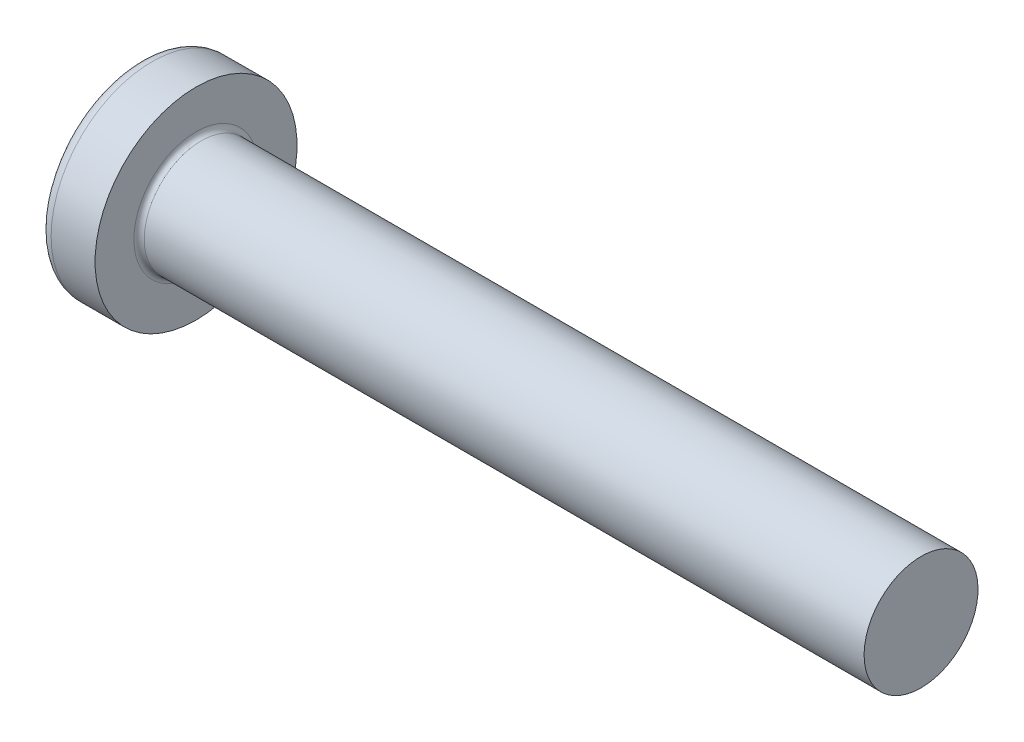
ISO-10303-21;
HEADER;
FILE_DESCRIPTION(('STEP AP214'),'2;1');
FILE_NAME('part.step','',(''),(''),'','','');
FILE_SCHEMA(('AUTOMOTIVE_DESIGN { 1 0 10303 214 1 1 1 1 }'));
ENDSEC;
DATA;
#1=APPLICATION_CONTEXT('core data for automotive mechanical design processes');
#2=APPLICATION_PROTOCOL_DEFINITION('international standard','automotive_design',2000,#1);
#3=PRODUCT_CONTEXT('',#1,'mechanical');
#4=PRODUCT('Part','Part','',(#3));
#5=PRODUCT_RELATED_PRODUCT_CATEGORY('part','',(#4));
#6=PRODUCT_DEFINITION_FORMATION('','',#4);
#7=PRODUCT_DEFINITION_CONTEXT('part definition',#1,'design');
#8=PRODUCT_DEFINITION('design','',#6,#7);
#9=PRODUCT_DEFINITION_SHAPE('','',#8);
#10=(LENGTH_UNIT() NAMED_UNIT(*) SI_UNIT(.MILLI.,.METRE.));
#11=(NAMED_UNIT(*) PLANE_ANGLE_UNIT() SI_UNIT($,.RADIAN.));
#12=(NAMED_UNIT(*) SI_UNIT($,.STERADIAN.) SOLID_ANGLE_UNIT());
#13=UNCERTAINTY_MEASURE_WITH_UNIT(LENGTH_MEASURE(1.E-05),#10,'distance_accuracy_value','');
#14=(GEOMETRIC_REPRESENTATION_CONTEXT(3) GLOBAL_UNCERTAINTY_ASSIGNED_CONTEXT((#13)) GLOBAL_UNIT_ASSIGNED_CONTEXT((#10,
#11,#12)) REPRESENTATION_CONTEXT('',''));
#15=CARTESIAN_POINT('',(0.,0.,0.));
#16=DIRECTION('',(0.,0.,1.));
#17=DIRECTION('',(1.,0.,0.));
#18=AXIS2_PLACEMENT_3D('',#15,#16,#17);
#19=CARTESIAN_POINT('',(1.20000000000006,0.601702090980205,-0.299999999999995));
#20=DIRECTION('',(-1.,0.,0.));
#21=DIRECTION('',(0.,-1.,0.));
#22=AXIS2_PLACEMENT_3D('',#19,#20,#21);
#23=PLANE('',#22);
#24=DIRECTION('',(0.,0.,-1.));
#25=VECTOR('',#24,1.);
#26=CARTESIAN_POINT('',(1.20000000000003,0.299999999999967,0.601702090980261));
#27=LINE('',#26,#25);
#28=CARTESIAN_POINT('',(1.20000000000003,0.299999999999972,-0.601702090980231));
#29=VERTEX_POINT('',#28);
#30=CARTESIAN_POINT('',(1.19999999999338,0.300000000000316,-0.468119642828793));
#31=VERTEX_POINT('',#30);
#32=EDGE_CURVE('E269',#29,#31,#27,.F.);
#33=ORIENTED_EDGE('',*,*,#32,.F.);
#34=DIRECTION('',(0.,1.,0.));
#35=VECTOR('',#34,1.);
#36=CARTESIAN_POINT('',(1.20000000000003,0.299999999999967,-0.601702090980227));
#37=LINE('',#36,#35);
#38=CARTESIAN_POINT('',(1.20000000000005,-0.299999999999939,-0.601702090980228));
#39=VERTEX_POINT('',#38);
#40=EDGE_CURVE('E274',#29,#39,#37,.F.);
#41=ORIENTED_EDGE('',*,*,#40,.T.);
#42=DIRECTION('',(0.,0.,1.));
#43=VECTOR('',#42,1.);
#44=CARTESIAN_POINT('',(1.20000000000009,-0.299999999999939,-0.601702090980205));
#45=LINE('',#44,#43);
#46=CARTESIAN_POINT('',(1.19999999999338,-0.300000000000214,-0.468119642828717));
#47=VERTEX_POINT('',#46);
#48=EDGE_CURVE('E321',#47,#39,#45,.F.);
#49=ORIENTED_EDGE('',*,*,#48,.F.);
#50=CARTESIAN_POINT('',(1.20000000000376,1.38791040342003E-13,0.));
#51=DIRECTION('',(-1.,0.,0.));
#52=DIRECTION('',(0.,0.,1.));
#53=AXIS2_PLACEMENT_3D('',#50,#51,#52);
#54=CIRCLE('',#53,0.556000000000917);
#55=EDGE_CURVE('E543',#47,#31,#54,.F.);
#56=ORIENTED_EDGE('',*,*,#55,.T.);
#57=EDGE_LOOP('',(#33,#41,#49,#56));
#58=FACE_BOUND('',#57,.T.);
#59=ADVANCED_FACE('F16',(#58),#23,.T.);
#60=CARTESIAN_POINT('',(1.20000000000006,0.601702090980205,-0.299999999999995));
#61=DIRECTION('',(-1.,0.,0.));
#62=DIRECTION('',(0.,-1.,0.));
#63=AXIS2_PLACEMENT_3D('',#60,#61,#62);
#64=PLANE('',#63);
#65=DIRECTION('',(0.,1.,0.));
#66=VECTOR('',#65,1.);
#67=CARTESIAN_POINT('',(1.20000000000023,-0.601702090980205,0.300000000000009));
#68=LINE('',#67,#66);
#69=CARTESIAN_POINT('',(1.20000000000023,0.601702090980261,0.300000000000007));
#70=VERTEX_POINT('',#69);
#71=CARTESIAN_POINT('',(1.19999999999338,0.468119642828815,0.300000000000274));
#72=VERTEX_POINT('',#71);
#73=EDGE_CURVE('E139',#70,#72,#68,.F.);
#74=ORIENTED_EDGE('',*,*,#73,.F.);
#75=DIRECTION('',(0.,0.,1.));
#76=VECTOR('',#75,1.);
#77=CARTESIAN_POINT('',(1.20000000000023,0.601702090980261,0.299999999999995));
#78=LINE('',#77,#76);
#79=CARTESIAN_POINT('',(1.20000000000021,0.601702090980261,-0.299999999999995));
#80=VERTEX_POINT('',#79);
#81=EDGE_CURVE('E262',#70,#80,#78,.F.);
#82=ORIENTED_EDGE('',*,*,#81,.T.);
#83=DIRECTION('',(0.,-1.,0.));
#84=VECTOR('',#83,1.);
#85=CARTESIAN_POINT('',(1.20000000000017,0.601702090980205,-0.299999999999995));
#86=LINE('',#85,#84);
#87=CARTESIAN_POINT('',(1.19999999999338,0.468119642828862,-0.300000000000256));
#88=VERTEX_POINT('',#87);
#89=EDGE_CURVE('E142',#88,#80,#86,.F.);
#90=ORIENTED_EDGE('',*,*,#89,.F.);
#91=CARTESIAN_POINT('',(1.20000000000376,1.38791040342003E-13,0.));
#92=DIRECTION('',(-1.,0.,0.));
#93=DIRECTION('',(0.,0.,1.));
#94=AXIS2_PLACEMENT_3D('',#91,#92,#93);
#95=CIRCLE('',#94,0.556000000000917);
#96=EDGE_CURVE('E136',#88,#72,#95,.F.);
#97=ORIENTED_EDGE('',*,*,#96,.T.);
#98=EDGE_LOOP('',(#74,#82,#90,#97));
#99=FACE_BOUND('',#98,.T.);
#100=ADVANCED_FACE('F138',(#99),#64,.T.);
#101=CARTESIAN_POINT('',(1.20000000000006,0.601702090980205,-0.299999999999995));
#102=DIRECTION('',(-1.,0.,0.));
#103=DIRECTION('',(0.,-1.,0.));
#104=AXIS2_PLACEMENT_3D('',#101,#102,#103);
#105=PLANE('',#104);
#106=DIRECTION('',(0.,0.,1.));
#107=VECTOR('',#106,1.);
#108=CARTESIAN_POINT('',(1.20000000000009,-0.299999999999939,-0.601702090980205));
#109=LINE('',#108,#107);
#110=CARTESIAN_POINT('',(1.20000000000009,-0.299999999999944,0.601702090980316));
#111=VERTEX_POINT('',#110);
#112=CARTESIAN_POINT('',(1.19999999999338,-0.300000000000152,0.468119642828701));
#113=VERTEX_POINT('',#112);
#114=EDGE_CURVE('E250',#111,#113,#109,.F.);
#115=ORIENTED_EDGE('',*,*,#114,.F.);
#116=DIRECTION('',(0.,1.,0.));
#117=VECTOR('',#116,1.);
#118=CARTESIAN_POINT('',(1.20000000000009,-0.299999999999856,0.601702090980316));
#119=LINE('',#118,#117);
#120=CARTESIAN_POINT('',(1.20000000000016,0.299999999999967,0.601702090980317));
#121=VERTEX_POINT('',#120);
#122=EDGE_CURVE('E255',#111,#121,#119,.T.);
#123=ORIENTED_EDGE('',*,*,#122,.T.);
#124=DIRECTION('',(0.,0.,-1.));
#125=VECTOR('',#124,1.);
#126=CARTESIAN_POINT('',(1.20000000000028,0.299999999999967,0.601702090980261));
#127=LINE('',#126,#125);
#128=CARTESIAN_POINT('',(1.19999999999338,0.300000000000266,0.46811964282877));
#129=VERTEX_POINT('',#128);
#130=EDGE_CURVE('E299',#129,#121,#127,.F.);
#131=ORIENTED_EDGE('',*,*,#130,.F.);
#132=CARTESIAN_POINT('',(1.20000000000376,1.38791040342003E-13,0.));
#133=DIRECTION('',(-1.,0.,0.));
#134=DIRECTION('',(0.,0.,1.));
#135=AXIS2_PLACEMENT_3D('',#132,#133,#134);
#136=CIRCLE('',#135,0.556000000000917);
#137=EDGE_CURVE('E148',#129,#113,#136,.F.);
#138=ORIENTED_EDGE('',*,*,#137,.T.);
#139=EDGE_LOOP('',(#115,#123,#131,#138));
#140=FACE_BOUND('',#139,.T.);
#141=ADVANCED_FACE('F558',(#140),#105,.T.);
#142=CARTESIAN_POINT('',(1.2000000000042,1.38791040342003E-13,0.));
#143=DIRECTION('',(-1.,0.,0.));
#144=DIRECTION('',(0.,0.,1.));
#145=AXIS2_PLACEMENT_3D('',#142,#143,#144);
#146=CONICAL_SURFACE('',#145,0.555999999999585,1.25663706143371);
#147=CARTESIAN_POINT('',(1.38065535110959,1.38777878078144E-13,0.));
#148=VERTEX_POINT('',#147);
#149=VERTEX_LOOP('',#148);
#150=FACE_BOUND('',#149,.T.);
#151=CARTESIAN_POINT('',(1.19999999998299,0.,0.));
#152=DIRECTION('',(-1.,0.,0.));
#153=DIRECTION('',(0.,0.,1.));
#154=AXIS2_PLACEMENT_3D('',#151,#152,#153);
#155=CIRCLE('',#154,0.556000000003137);
#156=EDGE_CURVE('E268',#88,#31,#155,.T.);
#157=ORIENTED_EDGE('',*,*,#156,.T.);
#158=ORIENTED_EDGE('',*,*,#55,.F.);
#159=CARTESIAN_POINT('',(1.19999999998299,0.,0.));
#160=DIRECTION('',(-1.,0.,0.));
#161=DIRECTION('',(0.,0.,1.));
#162=AXIS2_PLACEMENT_3D('',#159,#160,#161);
#163=CIRCLE('',#162,0.556000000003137);
#164=CARTESIAN_POINT('',(1.19999999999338,-0.468119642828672,-0.300000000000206));
#165=VERTEX_POINT('',#164);
#166=EDGE_CURVE('E329',#47,#165,#163,.T.);
#167=ORIENTED_EDGE('',*,*,#166,.T.);
#168=CARTESIAN_POINT('',(1.20000000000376,1.38791040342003E-13,0.));
#169=DIRECTION('',(-1.,0.,0.));
#170=DIRECTION('',(0.,0.,1.));
#171=AXIS2_PLACEMENT_3D('',#168,#169,#170);
#172=CIRCLE('',#171,0.556000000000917);
#173=CARTESIAN_POINT('',(1.19999999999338,-0.468119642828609,0.300000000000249));
#174=VERTEX_POINT('',#173);
#175=EDGE_CURVE('E289',#174,#165,#172,.F.);
#176=ORIENTED_EDGE('',*,*,#175,.F.);
#177=CARTESIAN_POINT('',(1.19999999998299,0.,0.));
#178=DIRECTION('',(-1.,0.,0.));
#179=DIRECTION('',(0.,0.,1.));
#180=AXIS2_PLACEMENT_3D('',#177,#178,#179);
#181=CIRCLE('',#180,0.556000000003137);
#182=EDGE_CURVE('E249',#174,#113,#181,.T.);
#183=ORIENTED_EDGE('',*,*,#182,.T.);
#184=ORIENTED_EDGE('',*,*,#137,.F.);
#185=CARTESIAN_POINT('',(1.19999999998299,0.,0.));
#186=DIRECTION('',(-1.,0.,0.));
#187=DIRECTION('',(0.,0.,1.));
#188=AXIS2_PLACEMENT_3D('',#185,#186,#187);
#189=CIRCLE('',#188,0.556000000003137);
#190=EDGE_CURVE('E161',#129,#72,#189,.T.);
#191=ORIENTED_EDGE('',*,*,#190,.T.);
#192=ORIENTED_EDGE('',*,*,#96,.F.);
#193=EDGE_LOOP('',(#157,#158,#167,#176,#183,#184,#191,#192));
#194=FACE_BOUND('',#193,.T.);
#195=ADVANCED_FACE('F162',(#150,#194),#146,.F.);
#196=CARTESIAN_POINT('',(1.20000000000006,0.601702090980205,-0.299999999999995));
#197=DIRECTION('',(-1.,0.,0.));
#198=DIRECTION('',(0.,-1.,0.));
#199=AXIS2_PLACEMENT_3D('',#196,#197,#198);
#200=PLANE('',#199);
#201=DIRECTION('',(0.,-1.,0.));
#202=VECTOR('',#201,1.);
#203=CARTESIAN_POINT('',(1.20000000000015,0.601702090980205,-0.299999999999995));
#204=LINE('',#203,#202);
#205=CARTESIAN_POINT('',(1.20000000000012,-0.601702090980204,-0.299999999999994));
#206=VERTEX_POINT('',#205);
#207=EDGE_CURVE('E285',#206,#165,#204,.F.);
#208=ORIENTED_EDGE('',*,*,#207,.F.);
#209=DIRECTION('',(0.,0.,1.));
#210=VECTOR('',#209,1.);
#211=CARTESIAN_POINT('',(1.2000000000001,-0.601702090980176,-0.300000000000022));
#212=LINE('',#211,#210);
#213=CARTESIAN_POINT('',(1.20000000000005,-0.601702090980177,0.300000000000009));
#214=VERTEX_POINT('',#213);
#215=EDGE_CURVE('E237',#206,#214,#212,.T.);
#216=ORIENTED_EDGE('',*,*,#215,.T.);
#217=DIRECTION('',(0.,1.,0.));
#218=VECTOR('',#217,1.);
#219=CARTESIAN_POINT('',(1.19999999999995,-0.601702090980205,0.300000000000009));
#220=LINE('',#219,#218);
#221=EDGE_CURVE('E243',#174,#214,#220,.F.);
#222=ORIENTED_EDGE('',*,*,#221,.F.);
#223=ORIENTED_EDGE('',*,*,#175,.T.);
#224=EDGE_LOOP('',(#208,#216,#222,#223));
#225=FACE_BOUND('',#224,.T.);
#226=ADVANCED_FACE('F547',(#225),#200,.T.);
#227=CARTESIAN_POINT('',(1.20000000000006,0.601702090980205,-0.299999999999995));
#228=DIRECTION('',(0.,0.,1.));
#229=DIRECTION('',(0.,-1.,0.));
#230=AXIS2_PLACEMENT_3D('',#227,#228,#229);
#231=PLANE('',#230);
#232=CARTESIAN_POINT('',(0.170303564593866,-1.11508977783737,-0.299999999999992));
#233=CARTESIAN_POINT('',(0.143844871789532,-1.02418894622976,-0.299999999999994));
#234=CARTESIAN_POINT('',(0.120668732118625,-0.932580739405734,-0.299999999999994));
#235=CARTESIAN_POINT('',(0.0808815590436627,-0.747949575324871,-0.299999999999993));
#236=CARTESIAN_POINT('',(0.0642705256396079,-0.654926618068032,-0.299999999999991));
#237=CARTESIAN_POINT('',(0.0509420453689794,-0.561196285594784,-0.299999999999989));
#238=B_SPLINE_CURVE_WITH_KNOTS('',3,(#232,#233,#234,#235,#236,#237),.UNSPECIFIED.,.F.,.F.,(4,2,
4),(0.,0.283483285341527,0.566966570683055),.UNSPECIFIED.);
#239=CARTESIAN_POINT('',(0.170303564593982,-1.11508977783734,-0.299999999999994));
#240=VERTEX_POINT('',#239);
#241=CARTESIAN_POINT('',(0.0509420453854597,-0.561196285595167,-0.299999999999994));
#242=VERTEX_POINT('',#241);
#243=EDGE_CURVE('E236',#240,#242,#238,.T.);
#244=ORIENTED_EDGE('',*,*,#243,.F.);
#245=DIRECTION('',(0.89493436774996,0.446197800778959,0.));
#246=VECTOR('',#245,1.);
#247=CARTESIAN_POINT('',(0.,-1.20000000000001,-0.299999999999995));
#248=LINE('',#247,#246);
#249=EDGE_CURVE('E240',#240,#206,#248,.T.);
#250=ORIENTED_EDGE('',*,*,#249,.T.);
#251=ORIENTED_EDGE('',*,*,#207,.T.);
#252=CARTESIAN_POINT('',(1.19999999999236,-0.468119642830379,-0.299999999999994));
#253=CARTESIAN_POINT('',(1.00851907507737,-0.48398728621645,-0.299999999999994));
#254=CARTESIAN_POINT('',(0.817023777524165,-0.499677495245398,-0.299999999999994));
#255=CARTESIAN_POINT('',(0.434004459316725,-0.530703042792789,-0.299999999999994));
#256=CARTESIAN_POINT('',(0.242480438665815,-0.546038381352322,-0.299999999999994));
#257=CARTESIAN_POINT('',(0.0509420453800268,-0.561196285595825,-0.299999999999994));
#258=B_SPLINE_CURVE_WITH_KNOTS('',3,(#252,#253,#254,#255,#256,#257),.UNSPECIFIED.,.F.,.F.,(4,2,
4),(0.,0.576411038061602,1.15282200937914),.UNSPECIFIED.);
#259=EDGE_CURVE('E288',#165,#242,#258,.T.);
#260=ORIENTED_EDGE('',*,*,#259,.T.);
#261=EDGE_LOOP('',(#244,#250,#251,#260));
#262=FACE_BOUND('',#261,.T.);
#263=ADVANCED_FACE('F469',(#262),#231,.T.);
#264=CARTESIAN_POINT('',(0.0509420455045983,0.,0.));
#265=DIRECTION('',(-1.,0.,0.));
#266=DIRECTION('',(0.,-1.,0.));
#267=AXIS2_PLACEMENT_3D('',#264,#265,#266);
#268=CONICAL_SURFACE('',#267,0.63634995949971,0.0698131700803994);
#269=CARTESIAN_POINT('',(0.0509420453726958,-0.299999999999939,-0.56119628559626));
#270=CARTESIAN_POINT('',(0.242480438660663,-0.299999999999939,-0.546038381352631));
#271=CARTESIAN_POINT('',(0.434004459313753,-0.299999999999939,-0.530703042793));
#272=CARTESIAN_POINT('',(0.81702377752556,-0.29999999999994,-0.499677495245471));
#273=CARTESIAN_POINT('',(1.00851907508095,-0.29999999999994,-0.483987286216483));
#274=CARTESIAN_POINT('',(1.19999999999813,-0.29999999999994,-0.468119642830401));
#275=B_SPLINE_CURVE_WITH_KNOTS('',3,(#269,#270,#271,#272,#273,#274),.UNSPECIFIED.,.F.,.F.,(4,2,
4),(0.,0.576410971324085,1.15282200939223),.UNSPECIFIED.);
#276=CARTESIAN_POINT('',(0.0509420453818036,-0.299999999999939,-0.561196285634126));
#277=VERTEX_POINT('',#276);
#278=EDGE_CURVE('E326',#277,#47,#275,.T.);
#279=ORIENTED_EDGE('',*,*,#278,.F.);
#280=CARTESIAN_POINT('',(0.0509420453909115,0.,0.));
#281=DIRECTION('',(-1.,0.,0.));
#282=DIRECTION('',(0.,-1.,0.));
#283=AXIS2_PLACEMENT_3D('',#280,#281,#282);
#284=CIRCLE('',#283,0.63634995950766);
#285=EDGE_CURVE('E461',#242,#277,#284,.F.);
#286=ORIENTED_EDGE('',*,*,#285,.F.);
#287=ORIENTED_EDGE('',*,*,#259,.F.);
#288=ORIENTED_EDGE('',*,*,#166,.F.);
#289=EDGE_LOOP('',(#279,#286,#287,#288));
#290=FACE_BOUND('',#289,.T.);
#291=ADVANCED_FACE('F442',(#290),#268,.F.);
#292=CARTESIAN_POINT('',(1.20000000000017,-0.299999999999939,-0.601702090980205));
#293=DIRECTION('',(0.,1.,0.));
#294=DIRECTION('',(0.,0.,1.));
#295=AXIS2_PLACEMENT_3D('',#292,#293,#294);
#296=PLANE('',#295);
#297=ORIENTED_EDGE('',*,*,#48,.T.);
#298=DIRECTION('',(-0.89493436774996,0.,-0.446197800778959));
#299=VECTOR('',#298,1.);
#300=CARTESIAN_POINT('',(2.2263223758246E-13,-0.299999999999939,-1.19999999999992));
#301=LINE('',#300,#299);
#302=CARTESIAN_POINT('',(0.170303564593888,-0.299999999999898,-1.11508977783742));
#303=VERTEX_POINT('',#302);
#304=EDGE_CURVE('E272',#39,#303,#301,.T.);
#305=ORIENTED_EDGE('',*,*,#304,.T.);
#306=CARTESIAN_POINT('',(4.,-0.29999999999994,0.));
#307=DIRECTION('',(0.,1.,0.));
#308=DIRECTION('',(0.,0.,1.));
#309=AXIS2_PLACEMENT_3D('',#306,#307,#308);
#310=CIRCLE('',#309,3.98873413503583);
#311=EDGE_CURVE('E459',#277,#303,#310,.F.);
#312=ORIENTED_EDGE('',*,*,#311,.F.);
#313=ORIENTED_EDGE('',*,*,#278,.T.);
#314=EDGE_LOOP('',(#297,#305,#312,#313));
#315=FACE_BOUND('',#314,.T.);
#316=ADVANCED_FACE('F444',(#315),#296,.T.);
#317=CARTESIAN_POINT('',(2.22044604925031E-13,0.299999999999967,-1.19999999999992));
#318=DIRECTION('',(0.446197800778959,0.,-0.89493436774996));
#319=DIRECTION('',(-0.89493436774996,0.,-0.446197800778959));
#320=AXIS2_PLACEMENT_3D('',#317,#318,#319);
#321=PLANE('',#320);
#322=ORIENTED_EDGE('',*,*,#40,.F.);
#323=DIRECTION('',(0.894934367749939,0.,0.446197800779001));
#324=VECTOR('',#323,1.);
#325=CARTESIAN_POINT('',(0.170303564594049,0.299999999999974,-1.11508977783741));
#326=LINE('',#325,#324);
#327=CARTESIAN_POINT('',(0.170303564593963,0.299999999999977,-1.11508977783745));
#328=VERTEX_POINT('',#327);
#329=EDGE_CURVE('E265',#328,#29,#326,.T.);
#330=ORIENTED_EDGE('',*,*,#329,.F.);
#331=CARTESIAN_POINT('',(0.170303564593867,-0.299999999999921,-1.11508977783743));
#332=CARTESIAN_POINT('',(0.163473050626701,-0.199999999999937,-1.1184953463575));
#333=CARTESIAN_POINT('',(0.160057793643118,-0.0999999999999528,-1.12019813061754));
#334=CARTESIAN_POINT('',(0.160057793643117,0.100000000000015,-1.12019813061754));
#335=CARTESIAN_POINT('',(0.163473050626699,0.2,-1.1184953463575));
#336=CARTESIAN_POINT('',(0.170303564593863,0.299999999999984,-1.11508977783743));
#337=B_SPLINE_CURVE_WITH_KNOTS('',3,(#331,#332,#333,#334,#335,#336),.UNSPECIFIED.,.F.,.F.,(4,2,
4),(0.,0.30021837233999,0.600436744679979),.UNSPECIFIED.);
#338=EDGE_CURVE('E453',#303,#328,#337,.T.);
#339=ORIENTED_EDGE('',*,*,#338,.F.);
#340=ORIENTED_EDGE('',*,*,#304,.F.);
#341=EDGE_LOOP('',(#322,#330,#339,#340));
#342=FACE_BOUND('',#341,.T.);
#343=ADVANCED_FACE('F447',(#342),#321,.F.);
#344=CARTESIAN_POINT('',(1.20000000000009,0.299999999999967,0.601702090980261));
#345=DIRECTION('',(0.,-1.,0.));
#346=DIRECTION('',(0.,0.,-1.));
#347=AXIS2_PLACEMENT_3D('',#344,#345,#346);
#348=PLANE('',#347);
#349=CARTESIAN_POINT('',(4.,0.299999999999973,0.));
#350=DIRECTION('',(0.,1.,0.));
#351=DIRECTION('',(0.,0.,1.));
#352=AXIS2_PLACEMENT_3D('',#349,#350,#351);
#353=CIRCLE('',#352,3.98873413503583);
#354=CARTESIAN_POINT('',(0.0509420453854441,0.299999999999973,-0.5611962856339));
#355=VERTEX_POINT('',#354);
#356=EDGE_CURVE('E407',#328,#355,#353,.T.);
#357=ORIENTED_EDGE('',*,*,#356,.F.);
#358=ORIENTED_EDGE('',*,*,#329,.T.);
#359=ORIENTED_EDGE('',*,*,#32,.T.);
#360=CARTESIAN_POINT('',(1.19999999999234,0.299999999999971,-0.468119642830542));
#361=CARTESIAN_POINT('',(1.00851907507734,0.299999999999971,-0.483987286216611));
#362=CARTESIAN_POINT('',(0.81702377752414,0.299999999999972,-0.499677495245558));
#363=CARTESIAN_POINT('',(0.434004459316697,0.299999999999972,-0.530703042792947));
#364=CARTESIAN_POINT('',(0.242480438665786,0.299999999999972,-0.546038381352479));
#365=CARTESIAN_POINT('',(0.0509420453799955,0.299999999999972,-0.56119628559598));
#366=B_SPLINE_CURVE_WITH_KNOTS('',3,(#360,#361,#362,#363,#364,#365),.UNSPECIFIED.,.F.,.F.,(4,2,
4),(0.,0.576411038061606,1.15282200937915),.UNSPECIFIED.);
#367=EDGE_CURVE('E315',#31,#355,#366,.T.);
#368=ORIENTED_EDGE('',*,*,#367,.T.);
#369=EDGE_LOOP('',(#357,#358,#359,#368));
#370=FACE_BOUND('',#369,.T.);
#371=ADVANCED_FACE('F422',(#370),#348,.T.);
#372=CARTESIAN_POINT('',(0.0509420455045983,0.,0.));
#373=DIRECTION('',(-1.,0.,0.));
#374=DIRECTION('',(0.,-1.,0.));
#375=AXIS2_PLACEMENT_3D('',#372,#373,#374);
#376=CONICAL_SURFACE('',#375,0.63634995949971,0.0698131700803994);
#377=ORIENTED_EDGE('',*,*,#367,.F.);
#378=ORIENTED_EDGE('',*,*,#156,.F.);
#379=CARTESIAN_POINT('',(0.0509420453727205,0.561196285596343,-0.299999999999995));
#380=CARTESIAN_POINT('',(0.242480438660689,0.546038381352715,-0.299999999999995));
#381=CARTESIAN_POINT('',(0.434004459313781,0.530703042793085,-0.299999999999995));
#382=CARTESIAN_POINT('',(0.817023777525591,0.499677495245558,-0.299999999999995));
#383=CARTESIAN_POINT('',(1.00851907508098,0.48398728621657,-0.299999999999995));
#384=CARTESIAN_POINT('',(1.19999999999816,0.46811964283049,-0.299999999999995));
#385=B_SPLINE_CURVE_WITH_KNOTS('',3,(#379,#380,#381,#382,#383,#384),.UNSPECIFIED.,.F.,.F.,(4,2,
4),(0.,0.57641097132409,1.15282200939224),.UNSPECIFIED.);
#386=CARTESIAN_POINT('',(0.0509420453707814,0.561196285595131,-0.299999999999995));
#387=VERTEX_POINT('',#386);
#388=EDGE_CURVE('E186',#387,#88,#385,.T.);
#389=ORIENTED_EDGE('',*,*,#388,.F.);
#390=CARTESIAN_POINT('',(0.0509420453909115,0.,0.));
#391=DIRECTION('',(-1.,0.,0.));
#392=DIRECTION('',(0.,-1.,0.));
#393=AXIS2_PLACEMENT_3D('',#390,#391,#392);
#394=CIRCLE('',#393,0.63634995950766);
#395=EDGE_CURVE('E406',#355,#387,#394,.F.);
#396=ORIENTED_EDGE('',*,*,#395,.F.);
#397=EDGE_LOOP('',(#377,#378,#389,#396));
#398=FACE_BOUND('',#397,.T.);
#399=ADVANCED_FACE('F416',(#398),#376,.F.);
#400=CARTESIAN_POINT('',(1.20000000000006,0.601702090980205,-0.299999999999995));
#401=DIRECTION('',(0.,0.,1.));
#402=DIRECTION('',(0.,-1.,0.));
#403=AXIS2_PLACEMENT_3D('',#400,#401,#402);
#404=PLANE('',#403);
#405=ORIENTED_EDGE('',*,*,#89,.T.);
#406=DIRECTION('',(-0.89493436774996,0.446197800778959,0.));
#407=VECTOR('',#406,1.);
#408=CARTESIAN_POINT('',(1.20000000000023,0.601702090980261,-0.299999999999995));
#409=LINE('',#408,#407);
#410=CARTESIAN_POINT('',(0.170303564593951,1.11508977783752,-0.300000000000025));
#411=VERTEX_POINT('',#410);
#412=EDGE_CURVE('E158',#80,#411,#409,.T.);
#413=ORIENTED_EDGE('',*,*,#412,.T.);
#414=CARTESIAN_POINT('',(0.0509420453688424,0.56119628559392,-0.299999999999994));
#415=CARTESIAN_POINT('',(0.0642705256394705,0.654926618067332,-0.299999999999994));
#416=CARTESIAN_POINT('',(0.0808815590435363,0.747949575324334,-0.299999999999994));
#417=CARTESIAN_POINT('',(0.120668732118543,0.932580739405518,-0.299999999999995));
#418=CARTESIAN_POINT('',(0.143844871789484,1.0241889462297,-0.299999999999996));
#419=CARTESIAN_POINT('',(0.170303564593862,1.11508977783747,-0.299999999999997));
#420=B_SPLINE_CURVE_WITH_KNOTS('',3,(#414,#415,#416,#417,#418,#419),.UNSPECIFIED.,.F.,.F.,(4,2,
4),(0.,0.283483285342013,0.566966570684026),.UNSPECIFIED.);
#421=EDGE_CURVE('E403',#387,#411,#420,.T.);
#422=ORIENTED_EDGE('',*,*,#421,.F.);
#423=ORIENTED_EDGE('',*,*,#388,.T.);
#424=EDGE_LOOP('',(#405,#413,#422,#423));
#425=FACE_BOUND('',#424,.T.);
#426=ADVANCED_FACE('F413',(#425),#404,.T.);
#427=CARTESIAN_POINT('',(1.20000000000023,0.601702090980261,0.299999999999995));
#428=DIRECTION('',(0.446197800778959,0.89493436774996,0.));
#429=DIRECTION('',(-0.89493436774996,0.446197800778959,0.));
#430=AXIS2_PLACEMENT_3D('',#427,#428,#429);
#431=PLANE('',#430);
#432=ORIENTED_EDGE('',*,*,#81,.F.);
#433=DIRECTION('',(0.894934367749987,-0.446197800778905,0.));
#434=VECTOR('',#433,1.);
#435=CARTESIAN_POINT('',(0.170303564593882,1.11508977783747,0.300000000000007));
#436=LINE('',#435,#434);
#437=CARTESIAN_POINT('',(0.170303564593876,1.11508977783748,0.300000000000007));
#438=VERTEX_POINT('',#437);
#439=EDGE_CURVE('E157',#438,#70,#436,.T.);
#440=ORIENTED_EDGE('',*,*,#439,.F.);
#441=CARTESIAN_POINT('',(0.170303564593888,1.11508977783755,-0.300000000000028));
#442=CARTESIAN_POINT('',(0.163473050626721,1.11849534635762,-0.200000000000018));
#443=CARTESIAN_POINT('',(0.160057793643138,1.12019813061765,-0.100000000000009));
#444=CARTESIAN_POINT('',(0.16005779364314,1.12019813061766,0.100000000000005));
#445=CARTESIAN_POINT('',(0.163473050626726,1.11849534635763,0.20000000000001));
#446=CARTESIAN_POINT('',(0.170303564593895,1.11508977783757,0.300000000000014));
#447=B_SPLINE_CURVE_WITH_KNOTS('',3,(#441,#442,#443,#444,#445,#446),.UNSPECIFIED.,.F.,.F.,(4,2,
4),(0.,0.300218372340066,0.600436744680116),.UNSPECIFIED.);
#448=EDGE_CURVE('E208',#411,#438,#447,.T.);
#449=ORIENTED_EDGE('',*,*,#448,.F.);
#450=ORIENTED_EDGE('',*,*,#412,.F.);
#451=EDGE_LOOP('',(#432,#440,#449,#450));
#452=FACE_BOUND('',#451,.T.);
#453=ADVANCED_FACE('F197',(#452),#431,.F.);
#454=CARTESIAN_POINT('',(1.19999999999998,-0.601702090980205,0.300000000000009));
#455=DIRECTION('',(0.,0.,-1.));
#456=DIRECTION('',(0.,1.,0.));
#457=AXIS2_PLACEMENT_3D('',#454,#455,#456);
#458=PLANE('',#457);
#459=CARTESIAN_POINT('',(0.17030356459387,1.11508977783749,0.300000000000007));
#460=CARTESIAN_POINT('',(0.143844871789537,1.02418894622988,0.300000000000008));
#461=CARTESIAN_POINT('',(0.120668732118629,0.932580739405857,0.300000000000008));
#462=CARTESIAN_POINT('',(0.080881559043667,0.747949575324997,0.300000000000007));
#463=CARTESIAN_POINT('',(0.0642705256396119,0.654926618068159,0.300000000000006));
#464=CARTESIAN_POINT('',(0.0509420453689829,0.561196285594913,0.300000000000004));
#465=B_SPLINE_CURVE_WITH_KNOTS('',3,(#459,#460,#461,#462,#463,#464),.UNSPECIFIED.,.F.,.F.,(4,2,
4),(0.,0.283483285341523,0.566966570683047),.UNSPECIFIED.);
#466=CARTESIAN_POINT('',(0.0509420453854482,0.561196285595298,0.300000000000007));
#467=VERTEX_POINT('',#466);
#468=EDGE_CURVE('E201',#438,#467,#465,.T.);
#469=ORIENTED_EDGE('',*,*,#468,.F.);
#470=ORIENTED_EDGE('',*,*,#439,.T.);
#471=ORIENTED_EDGE('',*,*,#73,.T.);
#472=CARTESIAN_POINT('',(1.19999999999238,0.468119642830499,0.300000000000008));
#473=CARTESIAN_POINT('',(1.00851907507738,0.483987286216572,0.300000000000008));
#474=CARTESIAN_POINT('',(0.81702377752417,0.499677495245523,0.300000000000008));
#475=CARTESIAN_POINT('',(0.434004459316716,0.530703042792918,0.300000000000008));
#476=CARTESIAN_POINT('',(0.242480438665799,0.546038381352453,0.300000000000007));
#477=CARTESIAN_POINT('',(0.0509420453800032,0.561196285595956,0.300000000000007));
#478=B_SPLINE_CURVE_WITH_KNOTS('',3,(#472,#473,#474,#475,#476,#477),.UNSPECIFIED.,.F.,.F.,(4,2,
4),(0.,0.576411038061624,1.15282200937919),.UNSPECIFIED.);
#479=EDGE_CURVE('E155',#72,#467,#478,.T.);
#480=ORIENTED_EDGE('',*,*,#479,.T.);
#481=EDGE_LOOP('',(#469,#470,#471,#480));
#482=FACE_BOUND('',#481,.T.);
#483=ADVANCED_FACE('F153',(#482),#458,.T.);
#484=CARTESIAN_POINT('',(0.0509420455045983,0.,0.));
#485=DIRECTION('',(-1.,0.,0.));
#486=DIRECTION('',(0.,-1.,0.));
#487=AXIS2_PLACEMENT_3D('',#484,#485,#486);
#488=CONICAL_SURFACE('',#487,0.63634995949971,0.0698131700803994);
#489=CARTESIAN_POINT('',(0.050942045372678,0.299999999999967,0.56119628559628));
#490=CARTESIAN_POINT('',(0.242480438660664,0.299999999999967,0.546038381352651));
#491=CARTESIAN_POINT('',(0.434004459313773,0.299999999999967,0.530703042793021));
#492=CARTESIAN_POINT('',(0.817023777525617,0.299999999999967,0.499677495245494));
#493=CARTESIAN_POINT('',(1.00851907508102,0.299999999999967,0.483987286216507));
#494=CARTESIAN_POINT('',(1.19999999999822,0.299999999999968,0.468119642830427));
#495=B_SPLINE_CURVE_WITH_KNOTS('',3,(#489,#490,#491,#492,#493,#494),.UNSPECIFIED.,.F.,.F.,(4,2,
4),(0.,0.576410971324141,1.15282200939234),.UNSPECIFIED.);
#496=CARTESIAN_POINT('',(0.0509420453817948,0.299999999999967,0.561196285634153));
#497=VERTEX_POINT('',#496);
#498=EDGE_CURVE('E166',#497,#129,#495,.T.);
#499=ORIENTED_EDGE('',*,*,#498,.F.);
#500=CARTESIAN_POINT('',(0.0509420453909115,0.,0.));
#501=DIRECTION('',(-1.,0.,0.));
#502=DIRECTION('',(0.,-1.,0.));
#503=AXIS2_PLACEMENT_3D('',#500,#501,#502);
#504=CIRCLE('',#503,0.63634995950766);
#505=EDGE_CURVE('E170',#467,#497,#504,.F.);
#506=ORIENTED_EDGE('',*,*,#505,.F.);
#507=ORIENTED_EDGE('',*,*,#479,.F.);
#508=ORIENTED_EDGE('',*,*,#190,.F.);
#509=EDGE_LOOP('',(#499,#506,#507,#508));
#510=FACE_BOUND('',#509,.T.);
#511=ADVANCED_FACE('F168',(#510),#488,.F.);
#512=CARTESIAN_POINT('',(1.20000000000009,0.299999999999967,0.601702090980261));
#513=DIRECTION('',(0.,-1.,0.));
#514=DIRECTION('',(0.,0.,-1.));
#515=AXIS2_PLACEMENT_3D('',#512,#513,#514);
#516=PLANE('',#515);
#517=ORIENTED_EDGE('',*,*,#130,.T.);
#518=DIRECTION('',(0.89493436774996,0.,-0.446197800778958));
#519=VECTOR('',#518,1.);
#520=CARTESIAN_POINT('',(1.20000000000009,0.299999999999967,0.601702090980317));
#521=LINE('',#520,#519);
#522=CARTESIAN_POINT('',(0.170303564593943,0.300000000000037,1.11508977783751));
#523=VERTEX_POINT('',#522);
#524=EDGE_CURVE('E253',#121,#523,#521,.F.);
#525=ORIENTED_EDGE('',*,*,#524,.T.);
#526=CARTESIAN_POINT('',(4.,0.299999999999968,0.));
#527=DIRECTION('',(0.,1.,0.));
#528=DIRECTION('',(0.,0.,1.));
#529=AXIS2_PLACEMENT_3D('',#526,#527,#528);
#530=CIRCLE('',#529,3.98873413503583);
#531=EDGE_CURVE('E395',#497,#523,#530,.T.);
#532=ORIENTED_EDGE('',*,*,#531,.F.);
#533=ORIENTED_EDGE('',*,*,#498,.T.);
#534=EDGE_LOOP('',(#517,#525,#532,#533));
#535=FACE_BOUND('',#534,.T.);
#536=ADVANCED_FACE('F386',(#535),#516,.T.);
#537=CARTESIAN_POINT('',(1.20000000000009,-0.299999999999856,0.601702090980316));
#538=DIRECTION('',(0.446197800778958,0.,0.89493436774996));
#539=DIRECTION('',(0.89493436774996,0.,-0.446197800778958));
#540=AXIS2_PLACEMENT_3D('',#537,#538,#539);
#541=PLANE('',#540);
#542=ORIENTED_EDGE('',*,*,#122,.F.);
#543=DIRECTION('',(0.894934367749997,0.,-0.446197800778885));
#544=VECTOR('',#543,1.);
#545=CARTESIAN_POINT('',(0.170303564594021,-0.299999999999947,1.11508977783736));
#546=LINE('',#545,#544);
#547=CARTESIAN_POINT('',(0.170303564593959,-0.299999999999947,1.11508977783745));
#548=VERTEX_POINT('',#547);
#549=EDGE_CURVE('E246',#548,#111,#546,.T.);
#550=ORIENTED_EDGE('',*,*,#549,.F.);
#551=CARTESIAN_POINT('',(0.170303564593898,0.30000000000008,1.11508977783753));
#552=CARTESIAN_POINT('',(0.163473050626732,0.200000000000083,1.1184953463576));
#553=CARTESIAN_POINT('',(0.160057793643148,0.100000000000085,1.12019813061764));
#554=CARTESIAN_POINT('',(0.160057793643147,-0.099999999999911,1.12019813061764));
#555=CARTESIAN_POINT('',(0.163473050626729,-0.199999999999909,1.1184953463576));
#556=CARTESIAN_POINT('',(0.170303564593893,-0.299999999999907,1.11508977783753));
#557=B_SPLINE_CURVE_WITH_KNOTS('',3,(#551,#552,#553,#554,#555,#556),.UNSPECIFIED.,.F.,.F.,(4,2,
4),(0.,0.300218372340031,0.600436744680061),.UNSPECIFIED.);
#558=EDGE_CURVE('E389',#523,#548,#557,.T.);
#559=ORIENTED_EDGE('',*,*,#558,.F.);
#560=ORIENTED_EDGE('',*,*,#524,.F.);
#561=EDGE_LOOP('',(#542,#550,#559,#560));
#562=FACE_BOUND('',#561,.T.);
#563=ADVANCED_FACE('F382',(#562),#541,.F.);
#564=CARTESIAN_POINT('',(1.20000000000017,-0.299999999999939,-0.601702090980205));
#565=DIRECTION('',(0.,1.,0.));
#566=DIRECTION('',(0.,0.,1.));
#567=AXIS2_PLACEMENT_3D('',#564,#565,#566);
#568=PLANE('',#567);
#569=CARTESIAN_POINT('',(4.,-0.299999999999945,0.));
#570=DIRECTION('',(0.,1.,0.));
#571=DIRECTION('',(0.,0.,1.));
#572=AXIS2_PLACEMENT_3D('',#569,#570,#571);
#573=CIRCLE('',#572,3.98873413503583);
#574=CARTESIAN_POINT('',(0.0509420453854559,-0.299999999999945,0.561196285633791));
#575=VERTEX_POINT('',#574);
#576=EDGE_CURVE('E394',#548,#575,#573,.F.);
#577=ORIENTED_EDGE('',*,*,#576,.F.);
#578=ORIENTED_EDGE('',*,*,#549,.T.);
#579=ORIENTED_EDGE('',*,*,#114,.T.);
#580=CARTESIAN_POINT('',(1.19999999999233,-0.299999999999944,0.468119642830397));
#581=CARTESIAN_POINT('',(1.00851907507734,-0.299999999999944,0.483987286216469));
#582=CARTESIAN_POINT('',(0.817023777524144,-0.299999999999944,0.499677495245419));
#583=CARTESIAN_POINT('',(0.434004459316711,-0.299999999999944,0.530703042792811));
#584=CARTESIAN_POINT('',(0.242480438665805,-0.299999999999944,0.546038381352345));
#585=CARTESIAN_POINT('',(0.0509420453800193,-0.299999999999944,0.561196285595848));
#586=B_SPLINE_CURVE_WITH_KNOTS('',3,(#580,#581,#582,#583,#584,#585),.UNSPECIFIED.,.F.,.F.,(4,2,
4),(0.,0.576411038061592,1.15282200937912),.UNSPECIFIED.);
#587=EDGE_CURVE('E293',#113,#575,#586,.T.);
#588=ORIENTED_EDGE('',*,*,#587,.T.);
#589=EDGE_LOOP('',(#577,#578,#579,#588));
#590=FACE_BOUND('',#589,.T.);
#591=ADVANCED_FACE('F378',(#590),#568,.T.);
#592=CARTESIAN_POINT('',(0.0509420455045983,0.,0.));
#593=DIRECTION('',(-1.,0.,0.));
#594=DIRECTION('',(0.,-1.,0.));
#595=AXIS2_PLACEMENT_3D('',#592,#593,#594);
#596=CONICAL_SURFACE('',#595,0.63634995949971,0.0698131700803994);
#597=ORIENTED_EDGE('',*,*,#587,.F.);
#598=ORIENTED_EDGE('',*,*,#182,.F.);
#599=CARTESIAN_POINT('',(0.0509420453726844,-0.561196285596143,0.300000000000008));
#600=CARTESIAN_POINT('',(0.242480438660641,-0.546038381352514,0.300000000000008));
#601=CARTESIAN_POINT('',(0.434004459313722,-0.530703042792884,0.300000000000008));
#602=CARTESIAN_POINT('',(0.817023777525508,-0.499677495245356,0.300000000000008));
#603=CARTESIAN_POINT('',(1.00851907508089,-0.483987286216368,0.300000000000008));
#604=CARTESIAN_POINT('',(1.19999999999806,-0.468119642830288,0.300000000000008));
#605=B_SPLINE_CURVE_WITH_KNOTS('',3,(#599,#600,#601,#602,#603,#604),.UNSPECIFIED.,.F.,.F.,(4,2,
4),(0.,0.576410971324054,1.15282200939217),.UNSPECIFIED.);
#606=CARTESIAN_POINT('',(0.0509420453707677,-0.561196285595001,0.300000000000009));
#607=VERTEX_POINT('',#606);
#608=EDGE_CURVE('E279',#607,#174,#605,.T.);
#609=ORIENTED_EDGE('',*,*,#608,.F.);
#610=CARTESIAN_POINT('',(0.0509420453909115,0.,0.));
#611=DIRECTION('',(-1.,0.,0.));
#612=DIRECTION('',(0.,-1.,0.));
#613=AXIS2_PLACEMENT_3D('',#610,#611,#612);
#614=CIRCLE('',#613,0.63634995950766);
#615=EDGE_CURVE('E353',#575,#607,#614,.F.);
#616=ORIENTED_EDGE('',*,*,#615,.F.);
#617=EDGE_LOOP('',(#597,#598,#609,#616));
#618=FACE_BOUND('',#617,.T.);
#619=ADVANCED_FACE('F359',(#618),#596,.F.);
#620=CARTESIAN_POINT('',(1.19999999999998,-0.601702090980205,0.300000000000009));
#621=DIRECTION('',(0.,0.,-1.));
#622=DIRECTION('',(0.,1.,0.));
#623=AXIS2_PLACEMENT_3D('',#620,#621,#622);
#624=PLANE('',#623);
#625=ORIENTED_EDGE('',*,*,#221,.T.);
#626=DIRECTION('',(0.89493436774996,0.446197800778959,0.));
#627=VECTOR('',#626,1.);
#628=CARTESIAN_POINT('',(0.,-1.20000000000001,0.300000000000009));
#629=LINE('',#628,#627);
#630=CARTESIAN_POINT('',(0.170303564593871,-1.11508977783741,0.299999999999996));
#631=VERTEX_POINT('',#630);
#632=EDGE_CURVE('E234',#214,#631,#629,.F.);
#633=ORIENTED_EDGE('',*,*,#632,.T.);
#634=CARTESIAN_POINT('',(0.050942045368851,-0.561196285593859,0.300000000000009));
#635=CARTESIAN_POINT('',(0.0642705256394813,-0.654926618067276,0.300000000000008));
#636=CARTESIAN_POINT('',(0.0808815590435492,-0.747949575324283,0.300000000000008));
#637=CARTESIAN_POINT('',(0.12066873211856,-0.932580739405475,0.300000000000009));
#638=CARTESIAN_POINT('',(0.143844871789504,-1.02418894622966,0.30000000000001));
#639=CARTESIAN_POINT('',(0.170303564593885,-1.11508977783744,0.300000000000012));
#640=B_SPLINE_CURVE_WITH_KNOTS('',3,(#634,#635,#636,#637,#638,#639),.UNSPECIFIED.,.F.,.F.,(4,2,
4),(0.,0.283483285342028,0.566966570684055),.UNSPECIFIED.);
#641=EDGE_CURVE('E347',#607,#631,#640,.T.);
#642=ORIENTED_EDGE('',*,*,#641,.F.);
#643=ORIENTED_EDGE('',*,*,#608,.T.);
#644=EDGE_LOOP('',(#625,#633,#642,#643));
#645=FACE_BOUND('',#644,.T.);
#646=ADVANCED_FACE('F355',(#645),#624,.T.);
#647=CARTESIAN_POINT('',(0.,-1.20000000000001,-0.300000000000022));
#648=DIRECTION('',(0.446197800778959,-0.89493436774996,0.));
#649=DIRECTION('',(0.89493436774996,0.446197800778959,0.));
#650=AXIS2_PLACEMENT_3D('',#647,#648,#649);
#651=PLANE('',#650);
#652=ORIENTED_EDGE('',*,*,#215,.F.);
#653=ORIENTED_EDGE('',*,*,#249,.F.);
#654=CARTESIAN_POINT('',(0.170303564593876,-1.11508977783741,0.299999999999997));
#655=CARTESIAN_POINT('',(0.163473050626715,-1.11849534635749,0.199999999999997));
#656=CARTESIAN_POINT('',(0.160057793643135,-1.12019813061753,0.0999999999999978));
#657=CARTESIAN_POINT('',(0.160057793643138,-1.12019813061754,-0.100000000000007));
#658=CARTESIAN_POINT('',(0.163473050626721,-1.1184953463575,-0.200000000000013));
#659=CARTESIAN_POINT('',(0.170303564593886,-1.11508977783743,-0.300000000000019));
#660=B_SPLINE_CURVE_WITH_KNOTS('',3,(#654,#655,#656,#657,#658,#659),.UNSPECIFIED.,.F.,.F.,(4,2,
4),(0.,0.300218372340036,0.60043674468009),.UNSPECIFIED.);
#661=EDGE_CURVE('E342',#631,#240,#660,.T.);
#662=ORIENTED_EDGE('',*,*,#661,.F.);
#663=ORIENTED_EDGE('',*,*,#632,.F.);
#664=EDGE_LOOP('',(#652,#653,#662,#663));
#665=FACE_BOUND('',#664,.T.);
#666=ADVANCED_FACE('F221',(#665),#651,.F.);
#667=CARTESIAN_POINT('',(4.,0.,0.));
#668=DIRECTION('',(0.,1.,0.));
#669=DIRECTION('',(1.,0.,0.));
#670=AXIS2_PLACEMENT_3D('',#667,#668,#669);
#671=SPHERICAL_SURFACE('',#670,4.);
#672=CARTESIAN_POINT('',(0.437599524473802,0.,0.));
#673=DIRECTION('',(-1.,0.,0.));
#674=DIRECTION('',(0.,0.,1.));
#675=AXIS2_PLACEMENT_3D('',#672,#673,#674);
#676=CIRCLE('',#675,1.81914893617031);
#677=CARTESIAN_POINT('',(0.437599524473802,0.,1.81914893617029));
#678=VERTEX_POINT('',#677);
#679=EDGE_CURVE('E338',#678,#678,#676,.F.);
#680=ORIENTED_EDGE('',*,*,#679,.F.);
#681=EDGE_LOOP('',(#680));
#682=FACE_BOUND('',#681,.T.);
#683=ORIENTED_EDGE('',*,*,#641,.T.);
#684=ORIENTED_EDGE('',*,*,#661,.T.);
#685=ORIENTED_EDGE('',*,*,#243,.T.);
#686=ORIENTED_EDGE('',*,*,#285,.T.);
#687=ORIENTED_EDGE('',*,*,#311,.T.);
#688=ORIENTED_EDGE('',*,*,#338,.T.);
#689=ORIENTED_EDGE('',*,*,#356,.T.);
#690=ORIENTED_EDGE('',*,*,#395,.T.);
#691=ORIENTED_EDGE('',*,*,#421,.T.);
#692=ORIENTED_EDGE('',*,*,#448,.T.);
#693=ORIENTED_EDGE('',*,*,#468,.T.);
#694=ORIENTED_EDGE('',*,*,#505,.T.);
#695=ORIENTED_EDGE('',*,*,#531,.T.);
#696=ORIENTED_EDGE('',*,*,#558,.T.);
#697=ORIENTED_EDGE('',*,*,#576,.T.);
#698=ORIENTED_EDGE('',*,*,#615,.T.);
#699=EDGE_LOOP('',(#683,#684,#685,#686,#687,#688,#689,#690,#691,#692,#693,#694,#695,#696,#697,#698));
#700=FACE_BOUND('',#699,.T.);
#701=ADVANCED_FACE('F214',(#682,#700),#671,.T.);
#702=CARTESIAN_POINT('',(0.651343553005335,0.,0.));
#703=DIRECTION('',(-1.,0.,0.));
#704=DIRECTION('',(0.,0.,1.));
#705=AXIS2_PLACEMENT_3D('',#702,#703,#704);
#706=TOROIDAL_SURFACE('',#705,1.71,0.24);
#707=ORIENTED_EDGE('',*,*,#679,.T.);
#708=EDGE_LOOP('',(#707));
#709=FACE_BOUND('',#708,.T.);
#710=CARTESIAN_POINT('',(0.651343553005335,0.,0.));
#711=DIRECTION('',(-1.,0.,0.));
#712=DIRECTION('',(0.,-1.,0.));
#713=AXIS2_PLACEMENT_3D('',#710,#711,#712);
#714=CIRCLE('',#713,1.95000000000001);
#715=CARTESIAN_POINT('',(0.651343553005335,-1.95000000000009,0.));
#716=VERTEX_POINT('',#715);
#717=EDGE_CURVE('E341',#716,#716,#714,.F.);
#718=ORIENTED_EDGE('',*,*,#717,.F.);
#719=EDGE_LOOP('',(#718));
#720=FACE_BOUND('',#719,.T.);
#721=ADVANCED_FACE('F220',(#709,#720),#706,.T.);
#722=CARTESIAN_POINT('',(-25.3999999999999,0.,0.));
#723=DIRECTION('',(-1.,0.,0.));
#724=DIRECTION('',(0.,-1.,0.));
#725=AXIS2_PLACEMENT_3D('',#722,#723,#724);
#726=CYLINDRICAL_SURFACE('',#725,1.95000000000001);
#727=ORIENTED_EDGE('',*,*,#717,.T.);
#728=EDGE_LOOP('',(#727));
#729=FACE_BOUND('',#728,.T.);
#730=CARTESIAN_POINT('',(1.50000000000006,0.,0.));
#731=DIRECTION('',(-1.,0.,0.));
#732=DIRECTION('',(0.,-1.,0.));
#733=AXIS2_PLACEMENT_3D('',#730,#731,#732);
#734=CIRCLE('',#733,1.95000000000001);
#735=CARTESIAN_POINT('',(1.50000000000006,-1.95000000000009,0.));
#736=VERTEX_POINT('',#735);
#737=EDGE_CURVE('E335',#736,#736,#734,.T.);
#738=ORIENTED_EDGE('',*,*,#737,.T.);
#739=EDGE_LOOP('',(#738));
#740=FACE_BOUND('',#739,.T.);
#741=ADVANCED_FACE('F519',(#729,#740),#726,.T.);
#742=CARTESIAN_POINT('',(1.50000000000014,1.10000000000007,0.));
#743=DIRECTION('',(-1.,0.,0.));
#744=DIRECTION('',(0.,-1.,0.));
#745=AXIS2_PLACEMENT_3D('',#742,#743,#744);
#746=PLANE('',#745);
#747=ORIENTED_EDGE('',*,*,#737,.F.);
#748=EDGE_LOOP('',(#747));
#749=FACE_BOUND('',#748,.T.);
#750=CARTESIAN_POINT('',(1.50000000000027,0.,0.));
#751=DIRECTION('',(1.,0.,0.));
#752=DIRECTION('',(0.,0.,1.));
#753=AXIS2_PLACEMENT_3D('',#750,#751,#752);
#754=CIRCLE('',#753,1.2);
#755=CARTESIAN_POINT('',(1.50000000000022,0.,-1.20000000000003));
#756=VERTEX_POINT('',#755);
#757=CARTESIAN_POINT('',(1.50000000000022,0.,1.19999999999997));
#758=VERTEX_POINT('',#757);
#759=EDGE_CURVE('E334',#756,#758,#754,.F.);
#760=ORIENTED_EDGE('',*,*,#759,.T.);
#761=CARTESIAN_POINT('',(1.50000000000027,0.,0.));
#762=DIRECTION('',(1.,0.,0.));
#763=DIRECTION('',(0.,0.,-1.));
#764=AXIS2_PLACEMENT_3D('',#761,#762,#763);
#765=CIRCLE('',#764,1.2);
#766=EDGE_CURVE('E35',#756,#758,#765,.T.);
#767=ORIENTED_EDGE('',*,*,#766,.F.);
#768=EDGE_LOOP('',(#760,#767));
#769=FACE_BOUND('',#768,.T.);
#770=ADVANCED_FACE('F511',(#749,#769),#746,.F.);
#771=CARTESIAN_POINT('',(15.5000000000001,1.10000000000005,0.));
#772=DIRECTION('',(1.,0.,0.));
#773=DIRECTION('',(0.,1.,0.));
#774=AXIS2_PLACEMENT_3D('',#771,#772,#773);
#775=PLANE('',#774);
#776=CARTESIAN_POINT('',(15.5000000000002,0.,0.));
#777=DIRECTION('',(-1.,0.,0.));
#778=DIRECTION('',(0.,-1.,0.));
#779=AXIS2_PLACEMENT_3D('',#776,#777,#778);
#780=CIRCLE('',#779,1.1);
#781=CARTESIAN_POINT('',(15.5000000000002,-1.10000000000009,0.));
#782=VERTEX_POINT('',#781);
#783=EDGE_CURVE('E27',#782,#782,#780,.T.);
#784=ORIENTED_EDGE('',*,*,#783,.F.);
#785=EDGE_LOOP('',(#784));
#786=FACE_BOUND('',#785,.T.);
#787=ADVANCED_FACE('F496',(#786),#775,.T.);
#788=CARTESIAN_POINT('',(1.60000000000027,0.,0.));
#789=DIRECTION('',(-1.,0.,0.));
#790=DIRECTION('',(0.,0.,1.));
#791=AXIS2_PLACEMENT_3D('',#788,#789,#790);
#792=TOROIDAL_SURFACE('',#791,1.2,0.1);
#793=ORIENTED_EDGE('',*,*,#766,.T.);
#794=ORIENTED_EDGE('',*,*,#759,.F.);
#795=EDGE_LOOP('',(#793,#794));
#796=FACE_BOUND('',#795,.T.);
#797=CARTESIAN_POINT('',(1.60000000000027,0.,0.));
#798=DIRECTION('',(-1.,0.,0.));
#799=DIRECTION('',(0.,-1.,0.));
#800=AXIS2_PLACEMENT_3D('',#797,#798,#799);
#801=CIRCLE('',#800,1.1);
#802=CARTESIAN_POINT('',(1.60000000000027,-1.10000000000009,0.));
#803=VERTEX_POINT('',#802);
#804=EDGE_CURVE('E11',#803,#803,#801,.F.);
#805=ORIENTED_EDGE('',*,*,#804,.F.);
#806=EDGE_LOOP('',(#805));
#807=FACE_BOUND('',#806,.T.);
#808=ADVANCED_FACE('F490',(#796,#807),#792,.F.);
#809=CARTESIAN_POINT('',(-25.3999999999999,0.,0.));
#810=DIRECTION('',(-1.,0.,0.));
#811=DIRECTION('',(0.,-1.,0.));
#812=AXIS2_PLACEMENT_3D('',#809,#810,#811);
#813=CYLINDRICAL_SURFACE('',#812,1.1);
#814=ORIENTED_EDGE('',*,*,#783,.T.);
#815=EDGE_LOOP('',(#814));
#816=FACE_BOUND('',#815,.T.);
#817=ORIENTED_EDGE('',*,*,#804,.T.);
#818=EDGE_LOOP('',(#817));
#819=FACE_BOUND('',#818,.T.);
#820=ADVANCED_FACE('F488',(#816,#819),#813,.T.);
#821=CLOSED_SHELL('',(#59,#100,#141,#195,#226,#263,#291,#316,#343,#371,#399,#426,#453,#483,#511,
#536,#563,#591,#619,#646,#666,#701,#721,#741,#770,#787,#808,#820));
#822=MANIFOLD_SOLID_BREP('B1',#821);
#823=ADVANCED_BREP_SHAPE_REPRESENTATION('',(#18,#822),#14);
#824=SHAPE_DEFINITION_REPRESENTATION(#9,#823);
ENDSEC;
END-ISO-10303-21;
